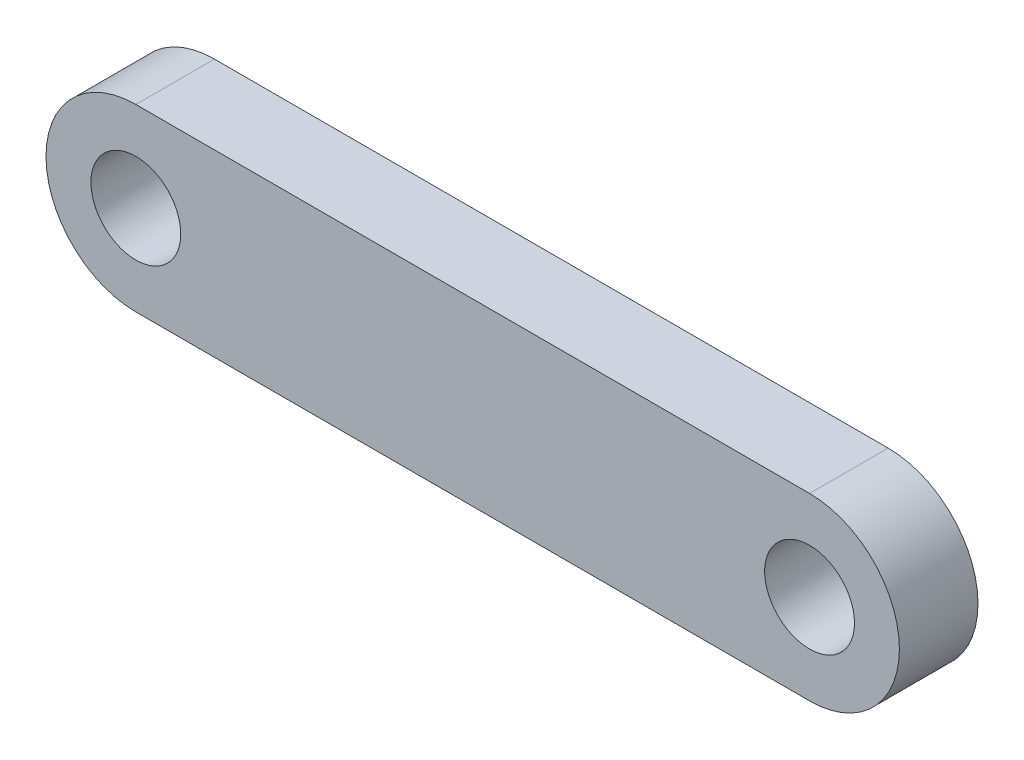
from build123d import *

# Parameters (mm, degrees)
SKETCH1_R      = 10
EXTRUDE1_DEPTH = 17.5


with BuildPart() as part:
    # Sketch1 → Extrude1 (new body)
    with BuildSketch(Plane.XY):
        with BuildLine():
            Line((75, -20), (-75, -20))
            ThreePointArc((-75, -20), (-95, 0), (-75, 20))
            Line((-75, 20), (75, 20))
            ThreePointArc((75, 20), (95, 0), (75, -20))
        make_face()
        with Locations((75, 0)):
            Circle(SKETCH1_R, mode=Mode.SUBTRACT)
        with Locations(Location((-75, 0, 0), (0, 0, 180))):
            Circle(SKETCH1_R, mode=Mode.SUBTRACT)
    extrude(amount=EXTRUDE1_DEPTH)


solid = part.part
